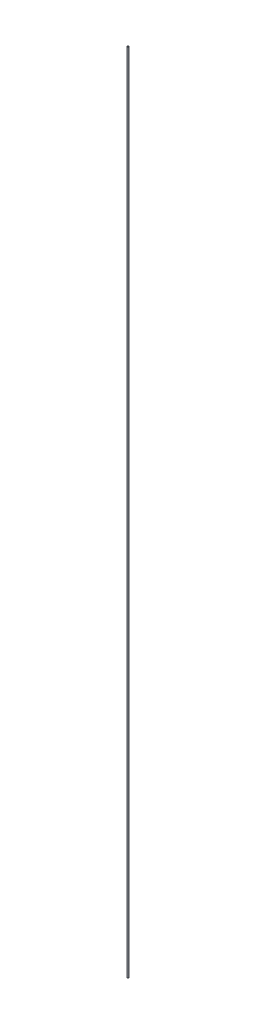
from build123d import *

# Parameters (mm, degrees)
ESQUISSE1_R      = 1.5
EXTRUSION1_DEPTH = 1680


with BuildPart() as part:
    # Esquisse1 → Extrusion1 (new body)
    with BuildSketch(Plane(origin=(0, 0, 0), x_dir=(1, 0, 0), z_dir=(0, 1, 0))):
        with Locations(Location((0, 0, 0), (0, 0, 270))):
            Circle(ESQUISSE1_R)
    extrude(amount=EXTRUSION1_DEPTH)


solid = part.part
